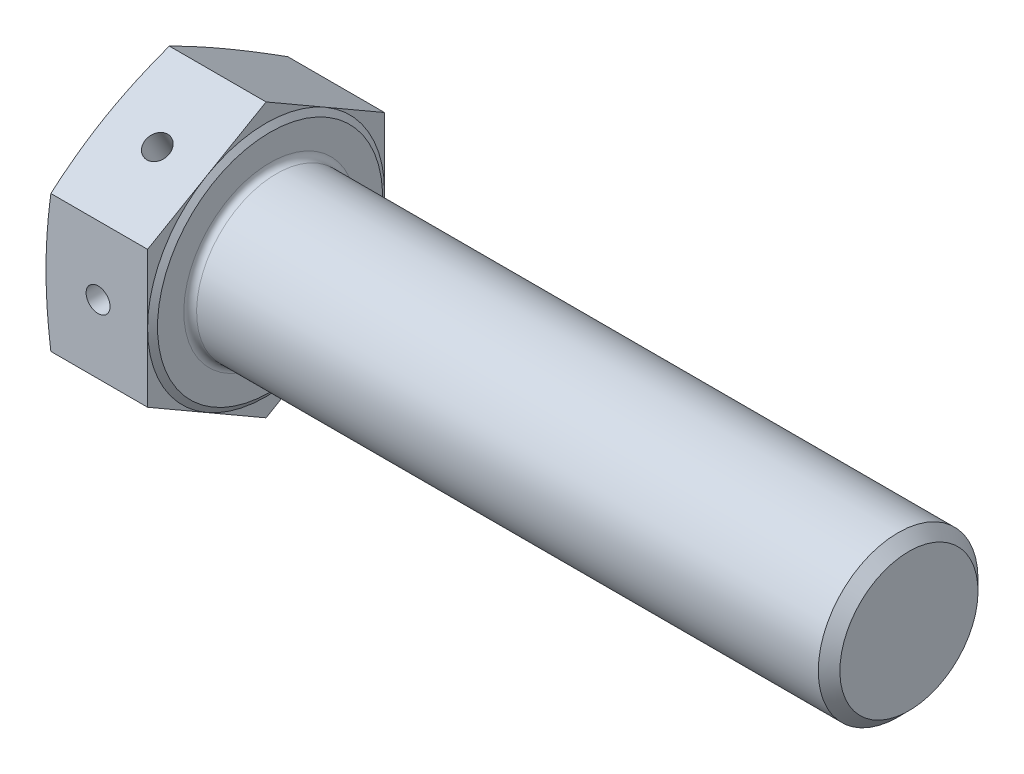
from build123d import *

# Parameters (mm, degrees)
BASEHEAD_DEPTH    = 12.72
SKETCH3_R         = 10
BASEBODY_DEPTH    = 80
CHAMFER1_SIZE     = 1.353
HEADFILLET_R      = 0.8
SKETCH5_R         = 1.5
HOLE_DEPTH        = 96.934779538
CIRPATTERN1_COUNT = 2
CIRPATTERN1_ANGLE = 60


with BuildPart() as part:
    # Sketch-BaseHead → BaseHead (new body)
    with BuildSketch(Plane(origin=(0, 0, 0), x_dir=(0, 0, -1), z_dir=(1, 0, 0))):
        Polygon((0, -17.129982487), (14.835, -8.564991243), (14.835, 8.564991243), (0, 17.129982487), (-14.835, 8.564991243), (-14.835, -8.564991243), align=None)
    extrude(amount=BASEHEAD_DEPTH)

    # Sketch4 → HeadChamfer (revolve, cut)
    with BuildSketch(Plane(origin=(-0.264637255, -5.916896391, 0), x_dir=(0, 1, 0), z_dir=(0, 0, 1))):
        Polygon((23.046878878, -0.264637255), (20.751896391, -0.264637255), (23.046878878, -0.872497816), align=None)
    revolve(axis=Axis((-4.001564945, 0, 0), (1, 0, 0)), mode=Mode.SUBTRACT)

    # Sketch2 → Revolve1 (revolve)
    with BuildSketch(Plane(origin=(0, 0, 0), x_dir=(1, 0, 0), z_dir=(0, 1, 0)), mode=Mode.PRIVATE) as revolve1_sk:
        Polygon((12.72, 0), (13.22, 0), (13.22, 14.095), (12.72, 14.835), align=None)
    revolve(revolve1_sk.sketch.rotate(Axis((-4.001564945, 0, 0), (1, 0, 0)), 270), axis=Axis((-4.001564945, 0, 0), (1, 0, 0)))

    # Sketch3 → BaseBody (add)
    with BuildSketch(Plane(origin=(13.22, 0, 0), x_dir=(0, 0, -1), z_dir=(1, 0, 0))):
        with Locations(Location((0, 0, 0), (0, 0, 270))):
            Circle(SKETCH3_R)
    extrude(amount=BASEBODY_DEPTH)

    # Chamfer1
    chamfer1_edges = [part.edges().sort_by_distance(p)[0] for p in [
        (93.22, 10, 0),
    ]]
    chamfer(chamfer1_edges, length=CHAMFER1_SIZE)

    # HeadFillet
    headfillet_edges = [part.edges().sort_by_distance(p)[0] for p in [
        (13.22, 10, 0),
    ]]
    fillet(headfillet_edges, radius=HEADFILLET_R)

    # Sketch5 → Hole (cut, symmetric)
    with BuildSketch(Plane.XY):
        with Locations((6.52, 0)):
            Circle(SKETCH5_R)
    hole = extrude(amount=HOLE_DEPTH, both=True, mode=Mode.SUBTRACT)

    # CirPattern1: Hole ×2 about axis
    cirpattern1_axis = Axis((93.22, 0, 0), (-1, 0, 0))
    for i in range(1, CIRPATTERN1_COUNT):
        add(hole.rotate(cirpattern1_axis, i * CIRPATTERN1_ANGLE / (CIRPATTERN1_COUNT - 1)), mode=Mode.SUBTRACT)


solid = part.part
